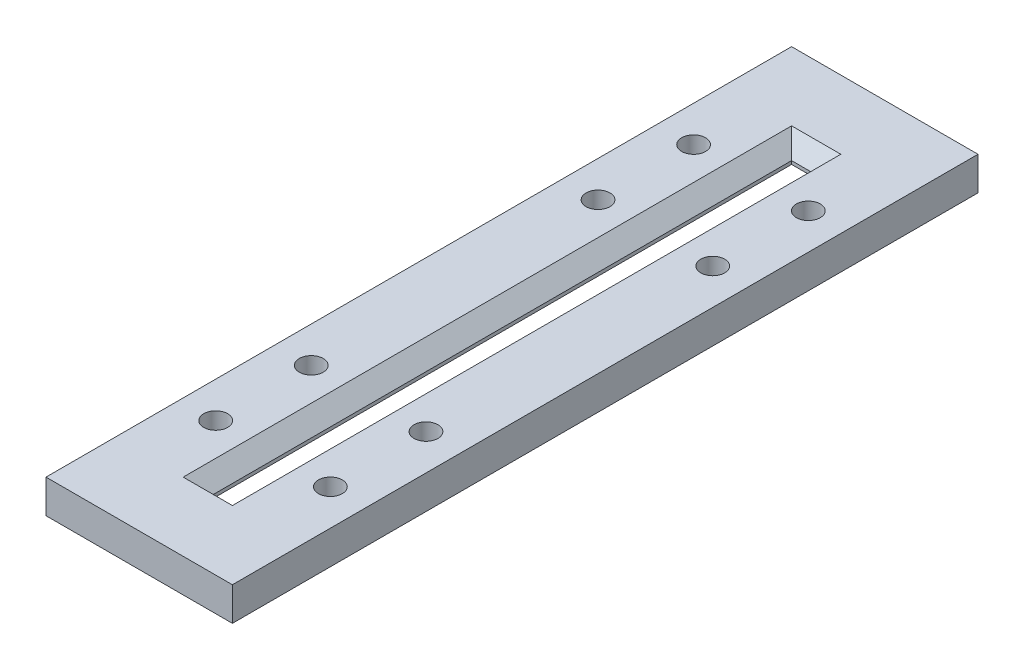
from build123d import *

# Parameters (mm, degrees)
SK_BLOCK_W          = 247.65
SK_BLOCK_H          = 990.6
SK_BLOCK_W_2        = 25.4
SK_BLOCK_H_2        = 768.35
BOSS_EXTRUDE1_DEPTH = 44.45
SK_HOLES_R          = 15.875
CUT_EXTRUDE1_DEPTH  = 513.474899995
CHAMFER1_SIZE       = 20


with BuildPart() as part:
    # sk block → Boss-Extrude1 (new body)
    with BuildSketch(Plane(origin=(0, 0, 0), x_dir=(-1, 0, 0), z_dir=(0, 1, 0))):
        Rectangle(SK_BLOCK_W, SK_BLOCK_H)
        Rectangle(SK_BLOCK_W_2, SK_BLOCK_H_2, mode=Mode.SUBTRACT)
    extrude(amount=BOSS_EXTRUDE1_DEPTH)

    # sk Holes → Cut-Extrude1 (cut, through all)
    with BuildSketch(Plane(origin=(0, 0, 0), x_dir=(-1, 0, 0), z_dir=(0, 1, 0))):
        with Locations(Location((-76.2, 317.5, 0), (0, 0, 90))):
            Circle(SK_HOLES_R)
        with Locations(Location((76.2, 317.5, 0), (0, 0, 90))):
            Circle(SK_HOLES_R)
        with Locations(Location((-76.2, -317.5, 0), (0, 0, 90))):
            Circle(SK_HOLES_R)
        with Locations(Location((76.2, -317.5, 0), (0, 0, 90))):
            Circle(SK_HOLES_R)
        with Locations(Location((-76.2, 190.5, 0), (0, 0, 90))):
            Circle(SK_HOLES_R)
        with Locations(Location((76.2, 190.5, 0), (0, 0, 90))):
            Circle(SK_HOLES_R)
        with Locations(Location((-76.2, -190.5, 0), (0, 0, 90))):
            Circle(SK_HOLES_R)
        with Locations(Location((76.2, -190.5, 0), (0, 0, 90))):
            Circle(SK_HOLES_R)
    extrude(amount=CUT_EXTRUDE1_DEPTH, mode=Mode.SUBTRACT)

    # Chamfer1
    chamfer1_edges = [part.edges().sort_by_distance(p)[0] for p in [
        (0, 0, 384.175),
        (12.7, 0, 0),
        (0, 0, -384.175),
        (-12.7, 0, 0),
        (0, 44.45, 384.175),
        (12.7, 44.45, 0),
        (0, 44.45, -384.175),
        (-12.7, 44.45, 0),
    ]]
    chamfer(chamfer1_edges, length=CHAMFER1_SIZE)


solid = part.part
